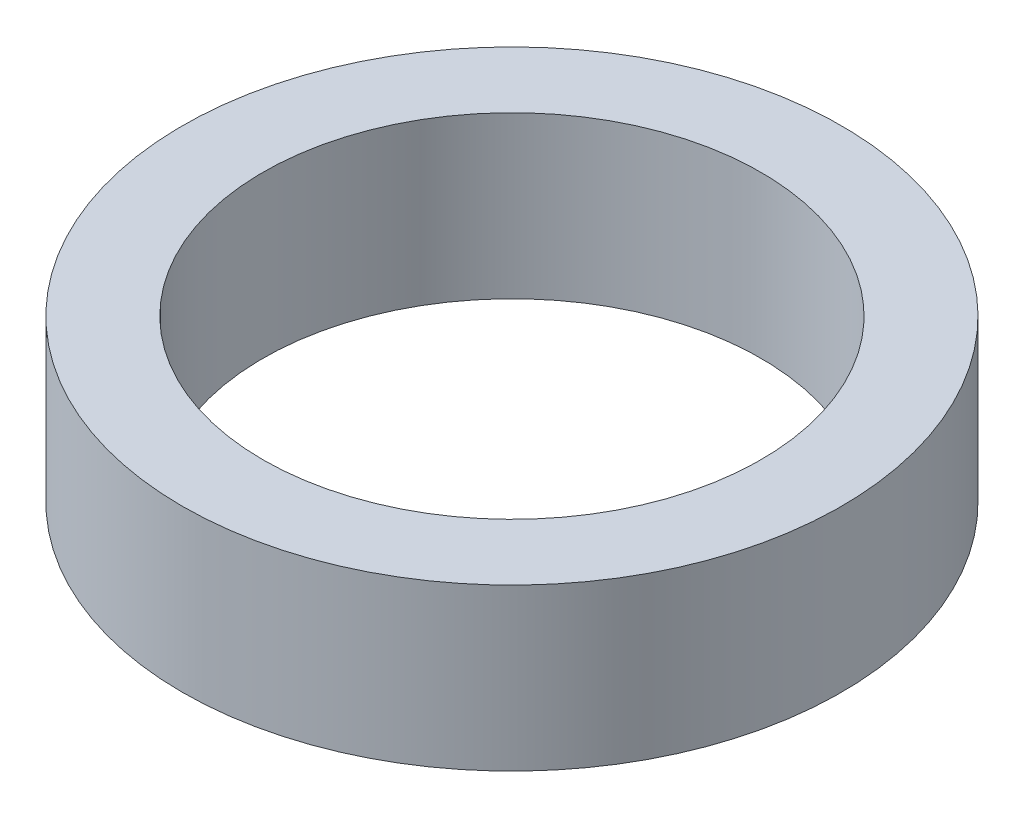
from build123d import *

# Parameters (mm, degrees)
SKETCH_1_R      = 22.5
SKETCH_1_R_2    = 17
EXTRUDE_1_DEPTH = 11


with BuildPart() as part:
    # Sketch 1 → Extrude 1 (new body)
    with BuildSketch(Plane(origin=(0, 0, 0), x_dir=(1, 0, 0), z_dir=(0, 1, 0))):
        with Locations(Location((0, 0, 0), (0, 0, 270))):
            Circle(SKETCH_1_R)
        with Locations(Location((0, 0, 0), (0, 0, 270))):
            Circle(SKETCH_1_R_2, mode=Mode.SUBTRACT)
    extrude(amount=EXTRUDE_1_DEPTH)


solid = part.part
